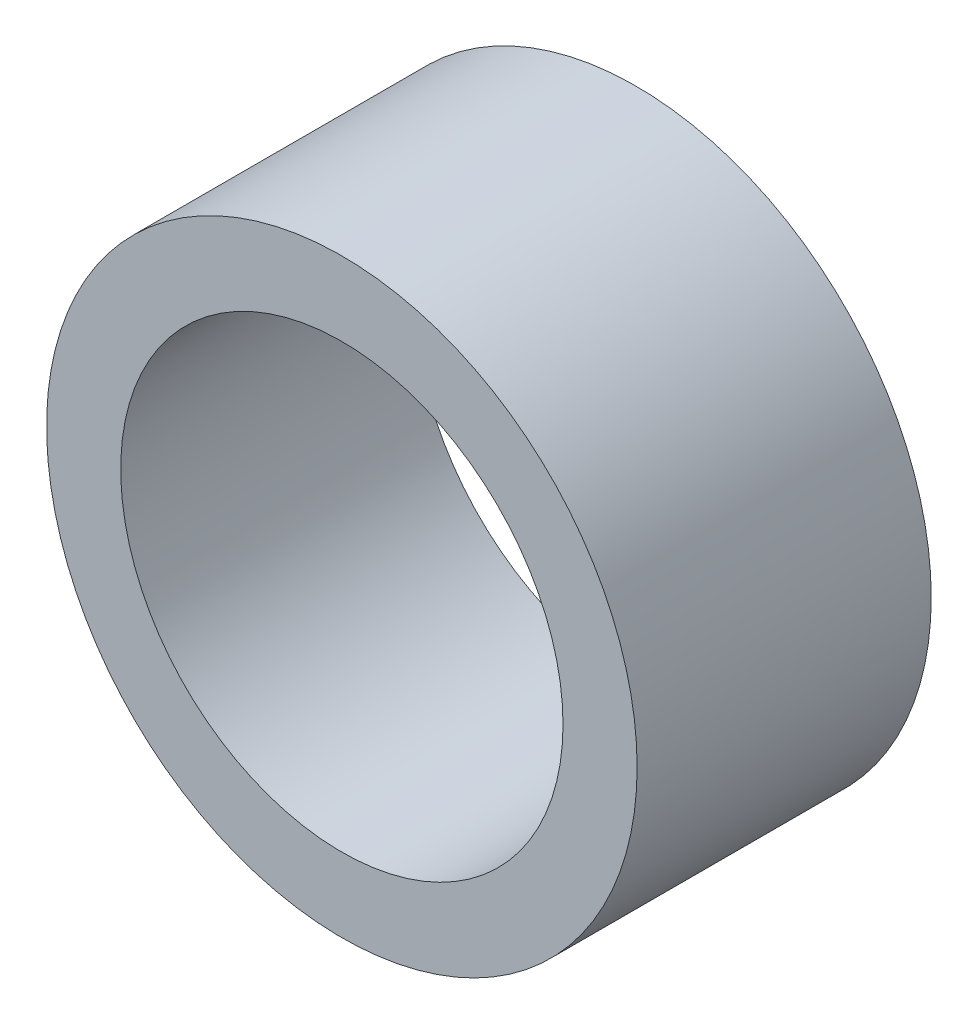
from build123d import *

# Parameters (mm, degrees)
BOSS_EXTRUDE1_DEPTH      = 3.175
BOSS_EXTRUDE1_DEPTH_BACK = 3.175
SKETCH5_R                = 6.3754
SKETCH5_R_2              = 4.7752


with BuildPart() as part:
    # Sketch5 → Boss-Extrude1 (new, two sides: drawn at the far end of the back side and taken through both)
    with BuildSketch(Plane.XY.offset(-BOSS_EXTRUDE1_DEPTH_BACK)):
        Circle(SKETCH5_R)
        Circle(SKETCH5_R_2, mode=Mode.SUBTRACT)
    extrude(amount=BOSS_EXTRUDE1_DEPTH + BOSS_EXTRUDE1_DEPTH_BACK)


solid = part.part
